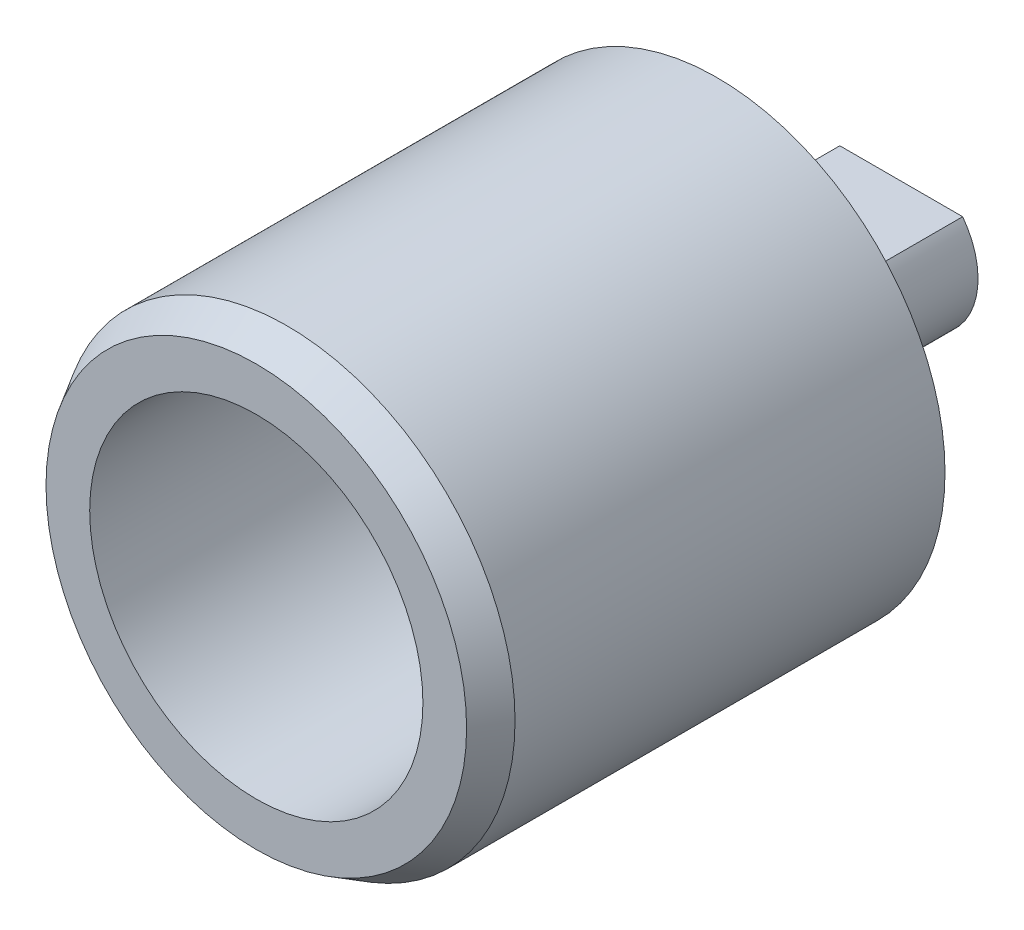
ISO-10303-21;
HEADER;
FILE_DESCRIPTION(('STEP AP214'),'2;1');
FILE_NAME('part.step','',(''),(''),'','','');
FILE_SCHEMA(('AUTOMOTIVE_DESIGN { 1 0 10303 214 1 1 1 1 }'));
ENDSEC;
DATA;
#1=APPLICATION_CONTEXT('core data for automotive mechanical design processes');
#2=APPLICATION_PROTOCOL_DEFINITION('international standard','automotive_design',2000,#1);
#3=PRODUCT_CONTEXT('',#1,'mechanical');
#4=PRODUCT('Part','Part','',(#3));
#5=PRODUCT_RELATED_PRODUCT_CATEGORY('part','',(#4));
#6=PRODUCT_DEFINITION_FORMATION('','',#4);
#7=PRODUCT_DEFINITION_CONTEXT('part definition',#1,'design');
#8=PRODUCT_DEFINITION('design','',#6,#7);
#9=PRODUCT_DEFINITION_SHAPE('','',#8);
#10=(LENGTH_UNIT() NAMED_UNIT(*) SI_UNIT(.MILLI.,.METRE.));
#11=(NAMED_UNIT(*) PLANE_ANGLE_UNIT() SI_UNIT($,.RADIAN.));
#12=(NAMED_UNIT(*) SI_UNIT($,.STERADIAN.) SOLID_ANGLE_UNIT());
#13=UNCERTAINTY_MEASURE_WITH_UNIT(LENGTH_MEASURE(1.E-05),#10,'distance_accuracy_value','');
#14=(GEOMETRIC_REPRESENTATION_CONTEXT(3) GLOBAL_UNCERTAINTY_ASSIGNED_CONTEXT((#13)) GLOBAL_UNIT_ASSIGNED_CONTEXT((#10,
#11,#12)) REPRESENTATION_CONTEXT('',''));
#15=CARTESIAN_POINT('',(0.,0.,0.));
#16=DIRECTION('',(0.,0.,1.));
#17=DIRECTION('',(1.,0.,0.));
#18=AXIS2_PLACEMENT_3D('',#15,#16,#17);
#19=CARTESIAN_POINT('',(0.,0.,-6.));
#20=DIRECTION('',(0.,0.,1.));
#21=DIRECTION('',(1.,0.,0.));
#22=AXIS2_PLACEMENT_3D('',#19,#20,#21);
#23=CYLINDRICAL_SURFACE('',#22,2.5);
#24=CARTESIAN_POINT('',(0.,0.,0.));
#25=DIRECTION('',(0.,0.,1.));
#26=DIRECTION('',(1.,0.,0.));
#27=AXIS2_PLACEMENT_3D('',#24,#25,#26);
#28=CIRCLE('',#27,2.5);
#29=CARTESIAN_POINT('',(-2.,1.5,0.));
#30=VERTEX_POINT('',#29);
#31=CARTESIAN_POINT('',(2.,1.5,0.));
#32=VERTEX_POINT('',#31);
#33=EDGE_CURVE('E72',#30,#32,#28,.T.);
#34=ORIENTED_EDGE('',*,*,#33,.F.);
#35=DIRECTION('',(0.,0.,1.));
#36=VECTOR('',#35,1.);
#37=CARTESIAN_POINT('',(-2.,1.5,-6.));
#38=LINE('',#37,#36);
#39=CARTESIAN_POINT('',(-2.,1.5,-6.));
#40=VERTEX_POINT('',#39);
#41=EDGE_CURVE('E64',#40,#30,#38,.T.);
#42=ORIENTED_EDGE('',*,*,#41,.F.);
#43=CARTESIAN_POINT('',(0.,0.,-6.));
#44=DIRECTION('',(0.,0.,1.));
#45=DIRECTION('',(1.,0.,0.));
#46=AXIS2_PLACEMENT_3D('',#43,#44,#45);
#47=CIRCLE('',#46,2.5);
#48=CARTESIAN_POINT('',(2.,1.5,-6.));
#49=VERTEX_POINT('',#48);
#50=EDGE_CURVE('E75',#40,#49,#47,.T.);
#51=ORIENTED_EDGE('',*,*,#50,.T.);
#52=DIRECTION('',(0.,0.,1.));
#53=VECTOR('',#52,1.);
#54=CARTESIAN_POINT('',(2.,1.5,-6.));
#55=LINE('',#54,#53);
#56=EDGE_CURVE('E73',#49,#32,#55,.T.);
#57=ORIENTED_EDGE('',*,*,#56,.T.);
#58=EDGE_LOOP('',(#34,#42,#51,#57));
#59=FACE_BOUND('',#58,.T.);
#60=ADVANCED_FACE('F46',(#59),#23,.T.);
#61=CARTESIAN_POINT('',(-2.,1.5,-6.));
#62=DIRECTION('',(0.,1.,0.));
#63=DIRECTION('',(0.,0.,1.));
#64=AXIS2_PLACEMENT_3D('',#61,#62,#63);
#65=PLANE('',#64);
#66=DIRECTION('',(-1.,0.,0.));
#67=VECTOR('',#66,1.);
#68=CARTESIAN_POINT('',(-2.,1.5,0.));
#69=LINE('',#68,#67);
#70=EDGE_CURVE('E83',#32,#30,#69,.T.);
#71=ORIENTED_EDGE('',*,*,#70,.F.);
#72=ORIENTED_EDGE('',*,*,#56,.F.);
#73=DIRECTION('',(-1.,0.,0.));
#74=VECTOR('',#73,1.);
#75=CARTESIAN_POINT('',(-2.,1.5,-6.));
#76=LINE('',#75,#74);
#77=EDGE_CURVE('E80',#49,#40,#76,.T.);
#78=ORIENTED_EDGE('',*,*,#77,.T.);
#79=ORIENTED_EDGE('',*,*,#41,.T.);
#80=EDGE_LOOP('',(#71,#72,#78,#79));
#81=FACE_BOUND('',#80,.T.);
#82=ADVANCED_FACE('F84',(#81),#65,.T.);
#83=CARTESIAN_POINT('',(0.,0.,-6.));
#84=DIRECTION('',(0.,0.,1.));
#85=DIRECTION('',(1.,0.,0.));
#86=AXIS2_PLACEMENT_3D('',#83,#84,#85);
#87=PLANE('',#86);
#88=ORIENTED_EDGE('',*,*,#50,.F.);
#89=ORIENTED_EDGE('',*,*,#77,.F.);
#90=EDGE_LOOP('',(#88,#89));
#91=FACE_BOUND('',#90,.T.);
#92=ADVANCED_FACE('F121',(#91),#87,.F.);
#93=CARTESIAN_POINT('',(0.,0.,0.));
#94=DIRECTION('',(0.,0.,1.));
#95=DIRECTION('',(1.,0.,0.));
#96=AXIS2_PLACEMENT_3D('',#93,#94,#95);
#97=PLANE('',#96);
#98=CARTESIAN_POINT('',(0.,0.,0.));
#99=DIRECTION('',(0.,0.,1.));
#100=DIRECTION('',(1.,0.,0.));
#101=AXIS2_PLACEMENT_3D('',#98,#99,#100);
#102=CIRCLE('',#101,7.425);
#103=CARTESIAN_POINT('',(7.425,0.,0.));
#104=VERTEX_POINT('',#103);
#105=EDGE_CURVE('E90',#104,#104,#102,.T.);
#106=ORIENTED_EDGE('',*,*,#105,.F.);
#107=EDGE_LOOP('',(#106));
#108=FACE_BOUND('',#107,.T.);
#109=ORIENTED_EDGE('',*,*,#70,.T.);
#110=ORIENTED_EDGE('',*,*,#33,.T.);
#111=EDGE_LOOP('',(#109,#110));
#112=FACE_BOUND('',#111,.T.);
#113=ADVANCED_FACE('F88',(#108,#112),#97,.F.);
#114=CARTESIAN_POINT('',(0.,0.,15.));
#115=DIRECTION('',(0.,0.,-1.));
#116=DIRECTION('',(-1.,0.,0.));
#117=AXIS2_PLACEMENT_3D('',#114,#115,#116);
#118=CYLINDRICAL_SURFACE('',#117,7.425);
#119=CARTESIAN_POINT('',(0.,0.,14.));
#120=DIRECTION('',(0.,0.,1.));
#121=DIRECTION('',(1.,0.,0.));
#122=AXIS2_PLACEMENT_3D('',#119,#120,#121);
#123=CIRCLE('',#122,7.425);
#124=CARTESIAN_POINT('',(7.425,0.,14.));
#125=VERTEX_POINT('',#124);
#126=EDGE_CURVE('E11',#125,#125,#123,.F.);
#127=ORIENTED_EDGE('',*,*,#126,.T.);
#128=EDGE_LOOP('',(#127));
#129=FACE_BOUND('',#128,.T.);
#130=ORIENTED_EDGE('',*,*,#105,.T.);
#131=EDGE_LOOP('',(#130));
#132=FACE_BOUND('',#131,.T.);
#133=ADVANCED_FACE('F127',(#129,#132),#118,.T.);
#134=CARTESIAN_POINT('',(0.,0.,15.));
#135=DIRECTION('',(0.,0.,1.));
#136=DIRECTION('',(1.,0.,0.));
#137=AXIS2_PLACEMENT_3D('',#134,#135,#136);
#138=PLANE('',#137);
#139=CARTESIAN_POINT('',(0.,0.,15.));
#140=DIRECTION('',(0.,0.,1.));
#141=DIRECTION('',(1.,0.,0.));
#142=AXIS2_PLACEMENT_3D('',#139,#140,#141);
#143=CIRCLE('',#142,6.84764973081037);
#144=CARTESIAN_POINT('',(6.84764973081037,0.,15.));
#145=VERTEX_POINT('',#144);
#146=EDGE_CURVE('E57',#145,#145,#143,.T.);
#147=ORIENTED_EDGE('',*,*,#146,.T.);
#148=EDGE_LOOP('',(#147));
#149=FACE_BOUND('',#148,.T.);
#150=CARTESIAN_POINT('',(0.,0.,15.));
#151=DIRECTION('',(0.,0.,1.));
#152=DIRECTION('',(1.,0.,0.));
#153=AXIS2_PLACEMENT_3D('',#150,#151,#152);
#154=CIRCLE('',#153,5.425);
#155=CARTESIAN_POINT('',(5.425,0.,15.));
#156=VERTEX_POINT('',#155);
#157=EDGE_CURVE('E145',#156,#156,#154,.T.);
#158=ORIENTED_EDGE('',*,*,#157,.F.);
#159=EDGE_LOOP('',(#158));
#160=FACE_BOUND('',#159,.T.);
#161=ADVANCED_FACE('F104',(#149,#160),#138,.T.);
#162=CARTESIAN_POINT('',(0.,0.,0.499999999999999));
#163=DIRECTION('',(0.,0.,1.));
#164=DIRECTION('',(1.,0.,0.));
#165=AXIS2_PLACEMENT_3D('',#162,#163,#164);
#166=CYLINDRICAL_SURFACE('',#165,5.425);
#167=CARTESIAN_POINT('',(0.,0.,0.499999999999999));
#168=DIRECTION('',(0.,0.,1.));
#169=DIRECTION('',(1.,0.,0.));
#170=AXIS2_PLACEMENT_3D('',#167,#168,#169);
#171=CIRCLE('',#170,5.425);
#172=CARTESIAN_POINT('',(5.425,0.,0.499999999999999));
#173=VERTEX_POINT('',#172);
#174=EDGE_CURVE('E94',#173,#173,#171,.T.);
#175=CARTESIAN_POINT('',(5.425,0.,0.499999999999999));
#176=CARTESIAN_POINT('',(5.425,0.,0.651041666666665));
#177=CARTESIAN_POINT('',(5.425,0.,0.802083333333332));
#178=CARTESIAN_POINT('',(5.425,0.,1.10416666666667));
#179=CARTESIAN_POINT('',(5.425,0.,1.25520833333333));
#180=CARTESIAN_POINT('',(5.425,0.,1.55729166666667));
#181=CARTESIAN_POINT('',(5.425,0.,1.70833333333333));
#182=CARTESIAN_POINT('',(5.425,0.,2.01041666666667));
#183=CARTESIAN_POINT('',(5.425,0.,2.16145833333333));
#184=CARTESIAN_POINT('',(5.425,0.,2.46354166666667));
#185=CARTESIAN_POINT('',(5.425,0.,2.61458333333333));
#186=CARTESIAN_POINT('',(5.425,0.,2.91666666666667));
#187=CARTESIAN_POINT('',(5.425,0.,3.06770833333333));
#188=CARTESIAN_POINT('',(5.425,0.,3.36979166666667));
#189=CARTESIAN_POINT('',(5.425,0.,3.52083333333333));
#190=CARTESIAN_POINT('',(5.425,0.,3.82291666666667));
#191=CARTESIAN_POINT('',(5.425,0.,3.97395833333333));
#192=CARTESIAN_POINT('',(5.425,0.,4.27604166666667));
#193=CARTESIAN_POINT('',(5.425,0.,4.42708333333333));
#194=CARTESIAN_POINT('',(5.425,0.,4.72916666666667));
#195=CARTESIAN_POINT('',(5.425,0.,4.88020833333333));
#196=CARTESIAN_POINT('',(5.425,0.,5.18229166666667));
#197=CARTESIAN_POINT('',(5.425,0.,5.33333333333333));
#198=CARTESIAN_POINT('',(5.425,0.,5.63541666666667));
#199=CARTESIAN_POINT('',(5.425,0.,5.78645833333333));
#200=CARTESIAN_POINT('',(5.425,0.,6.08854166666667));
#201=CARTESIAN_POINT('',(5.425,0.,6.23958333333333));
#202=CARTESIAN_POINT('',(5.425,0.,6.54166666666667));
#203=CARTESIAN_POINT('',(5.425,0.,6.69270833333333));
#204=CARTESIAN_POINT('',(5.425,0.,6.99479166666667));
#205=CARTESIAN_POINT('',(5.425,0.,7.14583333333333));
#206=CARTESIAN_POINT('',(5.425,0.,7.44791666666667));
#207=CARTESIAN_POINT('',(5.425,0.,7.59895833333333));
#208=CARTESIAN_POINT('',(5.425,0.,7.90104166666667));
#209=CARTESIAN_POINT('',(5.425,0.,8.05208333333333));
#210=CARTESIAN_POINT('',(5.425,0.,8.35416666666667));
#211=CARTESIAN_POINT('',(5.425,0.,8.50520833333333));
#212=CARTESIAN_POINT('',(5.425,0.,8.80729166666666));
#213=CARTESIAN_POINT('',(5.425,0.,8.95833333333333));
#214=CARTESIAN_POINT('',(5.425,0.,9.26041666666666));
#215=CARTESIAN_POINT('',(5.425,0.,9.41145833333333));
#216=CARTESIAN_POINT('',(5.425,0.,9.71354166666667));
#217=CARTESIAN_POINT('',(5.425,0.,9.86458333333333));
#218=CARTESIAN_POINT('',(5.425,0.,10.1666666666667));
#219=CARTESIAN_POINT('',(5.425,0.,10.3177083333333));
#220=CARTESIAN_POINT('',(5.425,0.,10.6197916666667));
#221=CARTESIAN_POINT('',(5.425,0.,10.7708333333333));
#222=CARTESIAN_POINT('',(5.425,0.,11.0729166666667));
#223=CARTESIAN_POINT('',(5.425,0.,11.2239583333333));
#224=CARTESIAN_POINT('',(5.425,0.,11.5260416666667));
#225=CARTESIAN_POINT('',(5.425,0.,11.6770833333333));
#226=CARTESIAN_POINT('',(5.425,0.,11.9791666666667));
#227=CARTESIAN_POINT('',(5.425,0.,12.1302083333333));
#228=CARTESIAN_POINT('',(5.425,0.,12.4322916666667));
#229=CARTESIAN_POINT('',(5.425,0.,12.5833333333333));
#230=CARTESIAN_POINT('',(5.425,0.,12.8854166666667));
#231=CARTESIAN_POINT('',(5.425,0.,13.0364583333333));
#232=CARTESIAN_POINT('',(5.425,0.,13.3385416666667));
#233=CARTESIAN_POINT('',(5.425,0.,13.4895833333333));
#234=CARTESIAN_POINT('',(5.425,0.,13.7916666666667));
#235=CARTESIAN_POINT('',(5.425,0.,13.9427083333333));
#236=CARTESIAN_POINT('',(5.425,0.,14.2447916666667));
#237=CARTESIAN_POINT('',(5.425,0.,14.3958333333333));
#238=CARTESIAN_POINT('',(5.425,0.,14.6979166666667));
#239=CARTESIAN_POINT('',(5.425,0.,14.8489583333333));
#240=CARTESIAN_POINT('',(5.425,0.,15.));
#241=B_SPLINE_CURVE_WITH_KNOTS('',3,(#175,#176,#177,#178,#179,#180,#181,#182,#183,#184,#185,
#186,#187,#188,#189,#190,#191,#192,#193,#194,#195,#196,#197,#198,#199,#200,#201,#202,#203,#204,
#205,#206,#207,#208,#209,#210,#211,#212,#213,#214,#215,#216,#217,#218,#219,#220,#221,#222,#223,
#224,#225,#226,#227,#228,#229,#230,#231,#232,#233,#234,#235,#236,#237,#238,#239,#240),
.UNSPECIFIED.,.F.,.F.,(4,2,2,2,2,2,2,2,2,2,2,2,2,2,2,2,2,2,2,2,2,2,2,2,2,2,2,2,2,2,2,2,4),(0.,
0.453125,0.90625,1.359375,1.8125,2.265625,2.71875,3.171875,3.625,4.078125,4.53125,4.984375,
5.4375,5.890625,6.34375,6.796875,7.25,7.703125,8.15625,8.609375,9.0625,9.515625,9.96875,
10.421875,10.875,11.328125,11.78125,12.234375,12.6875,13.140625,13.59375,14.046875,14.5),.UNSPECIFIED.);
#242=EDGE_CURVE('BSEAM113',#173,#156,#241,.T.);
#243=ORIENTED_EDGE('',*,*,#174,.F.);
#244=ORIENTED_EDGE('',*,*,#157,.T.);
#245=ORIENTED_EDGE('',*,*,#242,.T.);
#246=ORIENTED_EDGE('',*,*,#242,.F.);
#247=EDGE_LOOP('',(#243,#245,#244,#246));
#248=FACE_BOUND('',#247,.T.);
#249=ADVANCED_FACE('F113',(#248),#166,.F.);
#250=CARTESIAN_POINT('',(0.,0.,0.499999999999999));
#251=DIRECTION('',(0.,0.,1.));
#252=DIRECTION('',(1.,0.,0.));
#253=AXIS2_PLACEMENT_3D('',#250,#251,#252);
#254=PLANE('',#253);
#255=ORIENTED_EDGE('',*,*,#174,.T.);
#256=EDGE_LOOP('',(#255));
#257=FACE_BOUND('',#256,.T.);
#258=ADVANCED_FACE('F108',(#257),#254,.T.);
#259=CARTESIAN_POINT('',(0.,0.,15.));
#260=DIRECTION('',(0.,0.,-1.));
#261=DIRECTION('',(-1.,0.,0.));
#262=AXIS2_PLACEMENT_3D('',#259,#260,#261);
#263=CONICAL_SURFACE('',#262,6.84764973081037,0.523598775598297);
#264=ORIENTED_EDGE('',*,*,#126,.F.);
#265=EDGE_LOOP('',(#264));
#266=FACE_BOUND('',#265,.T.);
#267=ORIENTED_EDGE('',*,*,#146,.F.);
#268=EDGE_LOOP('',(#267));
#269=FACE_BOUND('',#268,.T.);
#270=ADVANCED_FACE('F49',(#266,#269),#263,.T.);
#271=CLOSED_SHELL('',(#60,#82,#92,#113,#133,#161,#249,#258,#270));
#272=MANIFOLD_SOLID_BREP('B2',#271);
#273=ADVANCED_BREP_SHAPE_REPRESENTATION('',(#18,#272),#14);
#274=SHAPE_DEFINITION_REPRESENTATION(#9,#273);
ENDSEC;
END-ISO-10303-21;
